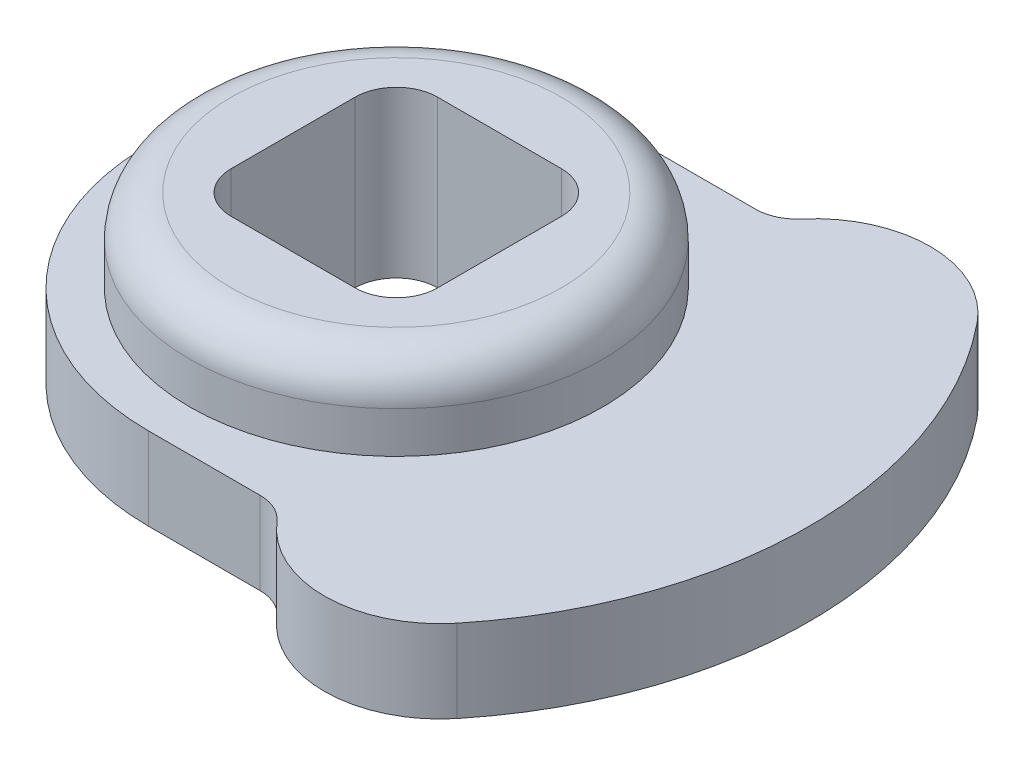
from build123d import *

# Parameters (mm, degrees)
SKETCH1_R           = 6.35
BOSS_EXTRUDE1_DEPTH = 5.08
BOSS_EXTRUDE2_DEPTH = 2.54
CUT_EXTRUDE1_DEPTH  = 17.549258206
FILLET1_R           = 1.27


with BuildPart() as part:
    # Sketch1 → Boss-Extrude1 (new body)
    with BuildSketch(Plane(origin=(0, 0, 0), x_dir=(1, 0, 0), z_dir=(0, 1, 0))):
        with Locations(Location((0, 0, 0), (0, 0, 270))):
            Circle(SKETCH1_R)
    extrude(amount=BOSS_EXTRUDE1_DEPTH)

    # Sketch2 → Boss-Extrude2 (add)
    with BuildSketch(Plane(origin=(0, 0, 0), x_dir=(1, 0, 0), z_dir=(0, 1, 0))):
        with BuildLine():
            Line((0, 7.62), (3.429, 7.62))
            ThreePointArc((3.429, 7.62), (3.961310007, 7.736940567), (4.395590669, 8.066226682))
            ThreePointArc((4.395590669, 8.066226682), (7.145413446, 9.315396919), (9.863950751, 7.99952971))
            ThreePointArc((9.863950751, 7.99952971), (12.7, 0), (9.863950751, -7.99952971))
            ThreePointArc((9.863950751, -7.99952971), (7.145413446, -9.315396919), (4.395590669, -8.066226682))
            ThreePointArc((4.395590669, -8.066226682), (3.961310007, -7.736940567), (3.429, -7.62))
            Line((3.429, -7.62), (0, -7.62))
            ThreePointArc((0, -7.62), (-7.62, 0), (0, 7.62))
        make_face()
    extrude(amount=BOSS_EXTRUDE2_DEPTH)

    # Sketch4 → Cut-Extrude1 (cut, through all)
    with BuildSketch(Plane(origin=(0, 5.08, 0), x_dir=(1, 0, 0), z_dir=(0, 1, 0))):
        with BuildLine():
            Line((-1.905, -3.175), (1.905, -3.175))
            ThreePointArc((1.905, -3.175), (2.803025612, -2.803025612), (3.175, -1.905))
            Line((3.175, -1.905), (3.175, 1.905))
            ThreePointArc((3.175, 1.905), (2.803025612, 2.803025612), (1.905, 3.175))
            Line((1.905, 3.175), (-1.905, 3.175))
            ThreePointArc((-1.905, 3.175), (-2.803025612, 2.803025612), (-3.175, 1.905))
            Line((-3.175, 1.905), (-3.175, -1.905))
            ThreePointArc((-3.175, -1.905), (-2.803025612, -2.803025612), (-1.905, -3.175))
        make_face()
    extrude(amount=-CUT_EXTRUDE1_DEPTH, mode=Mode.SUBTRACT)

    # Fillet1
    fillet1_edges = [part.edges().sort_by_distance(p)[0] for p in [
        (0, 5.08, -6.35),
    ]]
    fillet(fillet1_edges, radius=FILLET1_R)


solid = part.part
